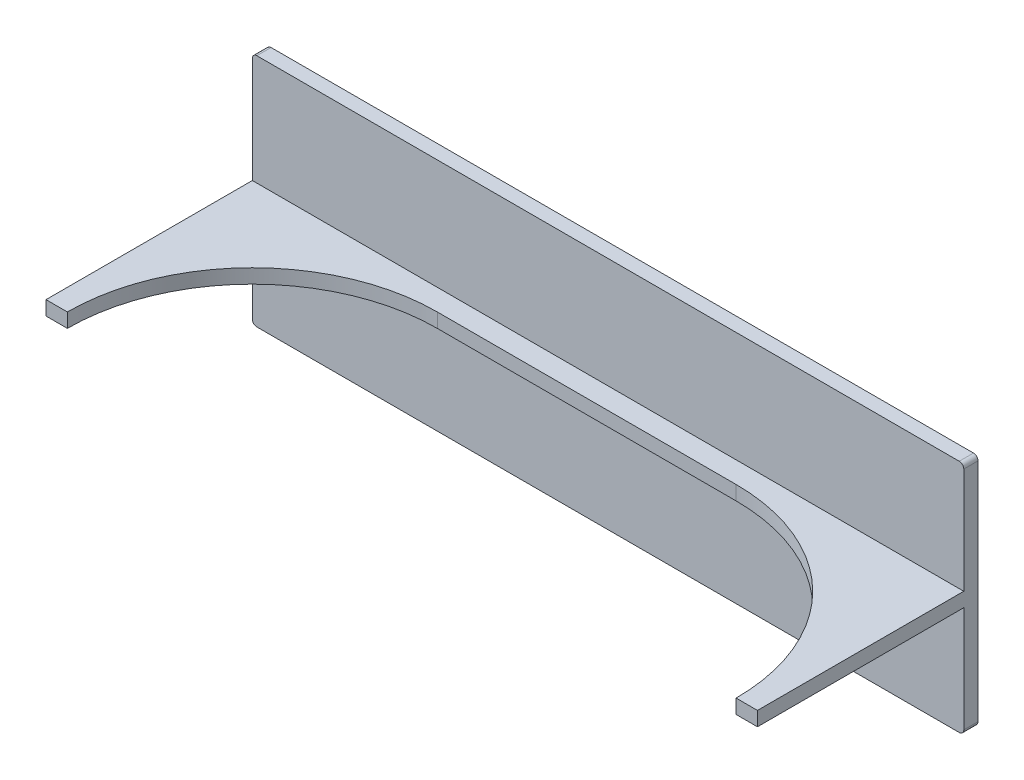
ISO-10303-21;
HEADER;
FILE_DESCRIPTION(('STEP AP214'),'2;1');
FILE_NAME('part.step','',(''),(''),'','','');
FILE_SCHEMA(('AUTOMOTIVE_DESIGN { 1 0 10303 214 1 1 1 1 }'));
ENDSEC;
DATA;
#1=APPLICATION_CONTEXT('core data for automotive mechanical design processes');
#2=APPLICATION_PROTOCOL_DEFINITION('international standard','automotive_design',2000,#1);
#3=PRODUCT_CONTEXT('',#1,'mechanical');
#4=PRODUCT('Part','Part','',(#3));
#5=PRODUCT_RELATED_PRODUCT_CATEGORY('part','',(#4));
#6=PRODUCT_DEFINITION_FORMATION('','',#4);
#7=PRODUCT_DEFINITION_CONTEXT('part definition',#1,'design');
#8=PRODUCT_DEFINITION('design','',#6,#7);
#9=PRODUCT_DEFINITION_SHAPE('','',#8);
#10=(LENGTH_UNIT() NAMED_UNIT(*) SI_UNIT(.MILLI.,.METRE.));
#11=(NAMED_UNIT(*) PLANE_ANGLE_UNIT() SI_UNIT($,.RADIAN.));
#12=(NAMED_UNIT(*) SI_UNIT($,.STERADIAN.) SOLID_ANGLE_UNIT());
#13=UNCERTAINTY_MEASURE_WITH_UNIT(LENGTH_MEASURE(1.E-05),#10,'distance_accuracy_value','');
#14=(GEOMETRIC_REPRESENTATION_CONTEXT(3) GLOBAL_UNCERTAINTY_ASSIGNED_CONTEXT((#13)) GLOBAL_UNIT_ASSIGNED_CONTEXT((#10,
#11,#12)) REPRESENTATION_CONTEXT('',''));
#15=CARTESIAN_POINT('',(0.,0.,0.));
#16=DIRECTION('',(0.,0.,1.));
#17=DIRECTION('',(1.,0.,0.));
#18=AXIS2_PLACEMENT_3D('',#15,#16,#17);
#19=CARTESIAN_POINT('',(0.,0.,10.));
#20=DIRECTION('',(0.,0.,-1.));
#21=DIRECTION('',(-1.,0.,0.));
#22=AXIS2_PLACEMENT_3D('',#19,#20,#21);
#23=PLANE('',#22);
#24=DIRECTION('',(0.,1.,0.));
#25=VECTOR('',#24,1.);
#26=CARTESIAN_POINT('',(250.,-82.55,10.));
#27=LINE('',#26,#25);
#28=CARTESIAN_POINT('',(250.,-79.37,10.));
#29=VERTEX_POINT('',#28);
#30=CARTESIAN_POINT('',(250.,-5.,10.));
#31=VERTEX_POINT('',#30);
#32=EDGE_CURVE('E229',#29,#31,#27,.T.);
#33=ORIENTED_EDGE('',*,*,#32,.T.);
#34=DIRECTION('',(-1.,0.,0.));
#35=VECTOR('',#34,1.);
#36=CARTESIAN_POINT('',(0.,-5.,10.));
#37=LINE('',#36,#35);
#38=CARTESIAN_POINT('',(-250.,-5.,10.));
#39=VERTEX_POINT('',#38);
#40=EDGE_CURVE('E68',#31,#39,#37,.T.);
#41=ORIENTED_EDGE('',*,*,#40,.T.);
#42=DIRECTION('',(0.,-1.,0.));
#43=VECTOR('',#42,1.);
#44=CARTESIAN_POINT('',(-250.,-82.55,10.));
#45=LINE('',#44,#43);
#46=CARTESIAN_POINT('',(-250.,-79.37,10.));
#47=VERTEX_POINT('',#46);
#48=EDGE_CURVE('E234',#39,#47,#45,.T.);
#49=ORIENTED_EDGE('',*,*,#48,.T.);
#50=CARTESIAN_POINT('',(-246.82,-79.37,10.));
#51=DIRECTION('',(0.,0.,-1.));
#52=DIRECTION('',(-1.,0.,0.));
#53=AXIS2_PLACEMENT_3D('',#50,#51,#52);
#54=CIRCLE('',#53,3.18);
#55=CARTESIAN_POINT('',(-246.82,-82.55,10.));
#56=VERTEX_POINT('',#55);
#57=EDGE_CURVE('E271',#47,#56,#54,.F.);
#58=ORIENTED_EDGE('',*,*,#57,.T.);
#59=DIRECTION('',(1.,0.,0.));
#60=VECTOR('',#59,1.);
#61=CARTESIAN_POINT('',(-250.,-82.55,10.));
#62=LINE('',#61,#60);
#63=CARTESIAN_POINT('',(246.82,-82.55,10.));
#64=VERTEX_POINT('',#63);
#65=EDGE_CURVE('E238',#56,#64,#62,.T.);
#66=ORIENTED_EDGE('',*,*,#65,.T.);
#67=CARTESIAN_POINT('',(246.82,-79.37,10.));
#68=DIRECTION('',(0.,0.,-1.));
#69=DIRECTION('',(-1.,0.,0.));
#70=AXIS2_PLACEMENT_3D('',#67,#68,#69);
#71=CIRCLE('',#70,3.18);
#72=EDGE_CURVE('E277',#64,#29,#71,.F.);
#73=ORIENTED_EDGE('',*,*,#72,.T.);
#74=EDGE_LOOP('',(#33,#41,#49,#58,#66,#73));
#75=FACE_BOUND('',#74,.T.);
#76=ADVANCED_FACE('F45',(#75),#23,.F.);
#77=CARTESIAN_POINT('',(250.,-82.55,10.));
#78=DIRECTION('',(-1.,0.,0.));
#79=DIRECTION('',(0.,-1.,0.));
#80=AXIS2_PLACEMENT_3D('',#77,#78,#79);
#81=PLANE('',#80);
#82=ORIENTED_EDGE('',*,*,#32,.F.);
#83=DIRECTION('',(0.,0.,-1.));
#84=VECTOR('',#83,1.);
#85=CARTESIAN_POINT('',(250.,-79.37,10.));
#86=LINE('',#85,#84);
#87=CARTESIAN_POINT('',(250.,-79.37,0.));
#88=VERTEX_POINT('',#87);
#89=EDGE_CURVE('E255',#29,#88,#86,.T.);
#90=ORIENTED_EDGE('',*,*,#89,.T.);
#91=DIRECTION('',(0.,1.,0.));
#92=VECTOR('',#91,1.);
#93=CARTESIAN_POINT('',(250.,-82.55,0.));
#94=LINE('',#93,#92);
#95=CARTESIAN_POINT('',(250.,79.37,0.));
#96=VERTEX_POINT('',#95);
#97=EDGE_CURVE('E228',#88,#96,#94,.T.);
#98=ORIENTED_EDGE('',*,*,#97,.T.);
#99=DIRECTION('',(0.,0.,-1.));
#100=VECTOR('',#99,1.);
#101=CARTESIAN_POINT('',(250.,79.37,10.));
#102=LINE('',#101,#100);
#103=CARTESIAN_POINT('',(250.,79.37,10.));
#104=VERTEX_POINT('',#103);
#105=EDGE_CURVE('E241',#96,#104,#102,.F.);
#106=ORIENTED_EDGE('',*,*,#105,.T.);
#107=CARTESIAN_POINT('',(250.,5.,10.));
#108=VERTEX_POINT('',#107);
#109=EDGE_CURVE('E185',#108,#104,#27,.T.);
#110=ORIENTED_EDGE('',*,*,#109,.F.);
#111=DIRECTION('',(0.,0.,1.));
#112=VECTOR('',#111,1.);
#113=CARTESIAN_POINT('',(250.,5.,0.));
#114=LINE('',#113,#112);
#115=CARTESIAN_POINT('',(250.,5.,155.));
#116=VERTEX_POINT('',#115);
#117=EDGE_CURVE('E177',#108,#116,#114,.T.);
#118=ORIENTED_EDGE('',*,*,#117,.T.);
#119=DIRECTION('',(0.,-1.,0.));
#120=VECTOR('',#119,1.);
#121=CARTESIAN_POINT('',(250.,5.,155.));
#122=LINE('',#121,#120);
#123=CARTESIAN_POINT('',(250.,-5.,155.));
#124=VERTEX_POINT('',#123);
#125=EDGE_CURVE('E160',#116,#124,#122,.T.);
#126=ORIENTED_EDGE('',*,*,#125,.T.);
#127=DIRECTION('',(0.,0.,1.));
#128=VECTOR('',#127,1.);
#129=CARTESIAN_POINT('',(250.,-5.,0.));
#130=LINE('',#129,#128);
#131=EDGE_CURVE('E191',#31,#124,#130,.T.);
#132=ORIENTED_EDGE('',*,*,#131,.F.);
#133=EDGE_LOOP('',(#82,#90,#98,#106,#110,#118,#126,#132));
#134=FACE_BOUND('',#133,.T.);
#135=ADVANCED_FACE('F183',(#134),#81,.F.);
#136=CARTESIAN_POINT('',(-250.,82.55,10.));
#137=DIRECTION('',(0.,-1.,0.));
#138=DIRECTION('',(1.,0.,0.));
#139=AXIS2_PLACEMENT_3D('',#136,#137,#138);
#140=PLANE('',#139);
#141=DIRECTION('',(-1.,0.,0.));
#142=VECTOR('',#141,1.);
#143=CARTESIAN_POINT('',(-250.,82.55,10.));
#144=LINE('',#143,#142);
#145=CARTESIAN_POINT('',(246.82,82.55,10.));
#146=VERTEX_POINT('',#145);
#147=CARTESIAN_POINT('',(-246.82,82.55,10.));
#148=VERTEX_POINT('',#147);
#149=EDGE_CURVE('E231',#146,#148,#144,.T.);
#150=ORIENTED_EDGE('',*,*,#149,.F.);
#151=DIRECTION('',(0.,0.,-1.));
#152=VECTOR('',#151,1.);
#153=CARTESIAN_POINT('',(246.82,82.55,10.));
#154=LINE('',#153,#152);
#155=CARTESIAN_POINT('',(246.82,82.55,0.));
#156=VERTEX_POINT('',#155);
#157=EDGE_CURVE('E281',#146,#156,#154,.T.);
#158=ORIENTED_EDGE('',*,*,#157,.T.);
#159=DIRECTION('',(-1.,0.,0.));
#160=VECTOR('',#159,1.);
#161=CARTESIAN_POINT('',(-250.,82.55,0.));
#162=LINE('',#161,#160);
#163=CARTESIAN_POINT('',(-246.82,82.55,0.));
#164=VERTEX_POINT('',#163);
#165=EDGE_CURVE('E244',#156,#164,#162,.T.);
#166=ORIENTED_EDGE('',*,*,#165,.T.);
#167=DIRECTION('',(0.,0.,-1.));
#168=VECTOR('',#167,1.);
#169=CARTESIAN_POINT('',(-246.82,82.55,10.));
#170=LINE('',#169,#168);
#171=EDGE_CURVE('E279',#164,#148,#170,.F.);
#172=ORIENTED_EDGE('',*,*,#171,.T.);
#173=EDGE_LOOP('',(#150,#158,#166,#172));
#174=FACE_BOUND('',#173,.T.);
#175=ADVANCED_FACE('F339',(#174),#140,.F.);
#176=CARTESIAN_POINT('',(-250.,-82.55,10.));
#177=DIRECTION('',(1.,0.,0.));
#178=DIRECTION('',(0.,0.,-1.));
#179=AXIS2_PLACEMENT_3D('',#176,#177,#178);
#180=PLANE('',#179);
#181=CARTESIAN_POINT('',(-250.,79.37,10.));
#182=VERTEX_POINT('',#181);
#183=CARTESIAN_POINT('',(-250.,5.,10.));
#184=VERTEX_POINT('',#183);
#185=EDGE_CURVE('E235',#182,#184,#45,.T.);
#186=ORIENTED_EDGE('',*,*,#185,.F.);
#187=DIRECTION('',(0.,0.,-1.));
#188=VECTOR('',#187,1.);
#189=CARTESIAN_POINT('',(-250.,79.37,10.));
#190=LINE('',#189,#188);
#191=CARTESIAN_POINT('',(-250.,79.37,0.));
#192=VERTEX_POINT('',#191);
#193=EDGE_CURVE('E11',#182,#192,#190,.T.);
#194=ORIENTED_EDGE('',*,*,#193,.T.);
#195=DIRECTION('',(0.,-1.,0.));
#196=VECTOR('',#195,1.);
#197=CARTESIAN_POINT('',(-250.,-82.55,0.));
#198=LINE('',#197,#196);
#199=CARTESIAN_POINT('',(-250.,-79.37,0.));
#200=VERTEX_POINT('',#199);
#201=EDGE_CURVE('E247',#192,#200,#198,.T.);
#202=ORIENTED_EDGE('',*,*,#201,.T.);
#203=DIRECTION('',(0.,0.,-1.));
#204=VECTOR('',#203,1.);
#205=CARTESIAN_POINT('',(-250.,-79.37,10.));
#206=LINE('',#205,#204);
#207=EDGE_CURVE('E53',#200,#47,#206,.F.);
#208=ORIENTED_EDGE('',*,*,#207,.T.);
#209=ORIENTED_EDGE('',*,*,#48,.F.);
#210=DIRECTION('',(0.,0.,1.));
#211=VECTOR('',#210,1.);
#212=CARTESIAN_POINT('',(-250.,-5.,0.));
#213=LINE('',#212,#211);
#214=CARTESIAN_POINT('',(-250.,-5.,155.));
#215=VERTEX_POINT('',#214);
#216=EDGE_CURVE('E201',#39,#215,#213,.T.);
#217=ORIENTED_EDGE('',*,*,#216,.T.);
#218=DIRECTION('',(0.,-1.,0.));
#219=VECTOR('',#218,1.);
#220=CARTESIAN_POINT('',(-250.,5.,155.));
#221=LINE('',#220,#219);
#222=CARTESIAN_POINT('',(-250.,5.,155.));
#223=VERTEX_POINT('',#222);
#224=EDGE_CURVE('E210',#223,#215,#221,.T.);
#225=ORIENTED_EDGE('',*,*,#224,.F.);
#226=DIRECTION('',(0.,0.,1.));
#227=VECTOR('',#226,1.);
#228=CARTESIAN_POINT('',(-250.,5.,0.));
#229=LINE('',#228,#227);
#230=EDGE_CURVE('E207',#184,#223,#229,.T.);
#231=ORIENTED_EDGE('',*,*,#230,.F.);
#232=EDGE_LOOP('',(#186,#194,#202,#208,#209,#217,#225,#231));
#233=FACE_BOUND('',#232,.T.);
#234=ADVANCED_FACE('F289',(#233),#180,.F.);
#235=CARTESIAN_POINT('',(-250.,-82.55,10.));
#236=DIRECTION('',(0.,1.,0.));
#237=DIRECTION('',(-1.,0.,0.));
#238=AXIS2_PLACEMENT_3D('',#235,#236,#237);
#239=PLANE('',#238);
#240=DIRECTION('',(1.,0.,0.));
#241=VECTOR('',#240,1.);
#242=CARTESIAN_POINT('',(-250.,-82.55,0.));
#243=LINE('',#242,#241);
#244=CARTESIAN_POINT('',(-246.82,-82.55,0.));
#245=VERTEX_POINT('',#244);
#246=CARTESIAN_POINT('',(246.82,-82.55,0.));
#247=VERTEX_POINT('',#246);
#248=EDGE_CURVE('E251',#245,#247,#243,.T.);
#249=ORIENTED_EDGE('',*,*,#248,.T.);
#250=DIRECTION('',(0.,0.,-1.));
#251=VECTOR('',#250,1.);
#252=CARTESIAN_POINT('',(246.82,-82.55,10.));
#253=LINE('',#252,#251);
#254=EDGE_CURVE('E269',#247,#64,#253,.F.);
#255=ORIENTED_EDGE('',*,*,#254,.T.);
#256=ORIENTED_EDGE('',*,*,#65,.F.);
#257=DIRECTION('',(0.,0.,-1.));
#258=VECTOR('',#257,1.);
#259=CARTESIAN_POINT('',(-246.82,-82.55,10.));
#260=LINE('',#259,#258);
#261=EDGE_CURVE('E266',#56,#245,#260,.T.);
#262=ORIENTED_EDGE('',*,*,#261,.T.);
#263=EDGE_LOOP('',(#249,#255,#256,#262));
#264=FACE_BOUND('',#263,.T.);
#265=ADVANCED_FACE('F297',(#264),#239,.F.);
#266=DIRECTION('',(-1.,0.,0.));
#267=VECTOR('',#266,1.);
#268=CARTESIAN_POINT('',(0.,5.,10.));
#269=LINE('',#268,#267);
#270=EDGE_CURVE('E60',#108,#184,#269,.T.);
#271=ORIENTED_EDGE('',*,*,#270,.F.);
#272=ORIENTED_EDGE('',*,*,#109,.T.);
#273=CARTESIAN_POINT('',(246.82,79.37,10.));
#274=DIRECTION('',(0.,0.,-1.));
#275=DIRECTION('',(-1.,0.,0.));
#276=AXIS2_PLACEMENT_3D('',#273,#274,#275);
#277=CIRCLE('',#276,3.18);
#278=EDGE_CURVE('E275',#104,#146,#277,.F.);
#279=ORIENTED_EDGE('',*,*,#278,.T.);
#280=ORIENTED_EDGE('',*,*,#149,.T.);
#281=CARTESIAN_POINT('',(-246.82,79.37,10.));
#282=DIRECTION('',(0.,0.,-1.));
#283=DIRECTION('',(-1.,0.,0.));
#284=AXIS2_PLACEMENT_3D('',#281,#282,#283);
#285=CIRCLE('',#284,3.18);
#286=EDGE_CURVE('E273',#148,#182,#285,.F.);
#287=ORIENTED_EDGE('',*,*,#286,.T.);
#288=ORIENTED_EDGE('',*,*,#185,.T.);
#289=EDGE_LOOP('',(#271,#272,#279,#280,#287,#288));
#290=FACE_BOUND('',#289,.T.);
#291=ADVANCED_FACE('F324',(#290),#23,.F.);
#292=CARTESIAN_POINT('',(0.,0.,0.));
#293=DIRECTION('',(0.,0.,-1.));
#294=DIRECTION('',(-1.,0.,0.));
#295=AXIS2_PLACEMENT_3D('',#292,#293,#294);
#296=PLANE('',#295);
#297=ORIENTED_EDGE('',*,*,#97,.F.);
#298=CARTESIAN_POINT('',(246.82,-79.37,0.));
#299=DIRECTION('',(0.,0.,-1.));
#300=DIRECTION('',(-1.,0.,0.));
#301=AXIS2_PLACEMENT_3D('',#298,#299,#300);
#302=CIRCLE('',#301,3.18);
#303=EDGE_CURVE('E264',#88,#247,#302,.T.);
#304=ORIENTED_EDGE('',*,*,#303,.T.);
#305=ORIENTED_EDGE('',*,*,#248,.F.);
#306=CARTESIAN_POINT('',(-246.82,-79.37,0.));
#307=DIRECTION('',(0.,0.,-1.));
#308=DIRECTION('',(-1.,0.,0.));
#309=AXIS2_PLACEMENT_3D('',#306,#307,#308);
#310=CIRCLE('',#309,3.18);
#311=EDGE_CURVE('E258',#245,#200,#310,.T.);
#312=ORIENTED_EDGE('',*,*,#311,.T.);
#313=ORIENTED_EDGE('',*,*,#201,.F.);
#314=CARTESIAN_POINT('',(-246.82,79.37,0.));
#315=DIRECTION('',(0.,0.,-1.));
#316=DIRECTION('',(-1.,0.,0.));
#317=AXIS2_PLACEMENT_3D('',#314,#315,#316);
#318=CIRCLE('',#317,3.18);
#319=EDGE_CURVE('E260',#192,#164,#318,.T.);
#320=ORIENTED_EDGE('',*,*,#319,.T.);
#321=ORIENTED_EDGE('',*,*,#165,.F.);
#322=CARTESIAN_POINT('',(246.82,79.37,0.));
#323=DIRECTION('',(0.,0.,-1.));
#324=DIRECTION('',(-1.,0.,0.));
#325=AXIS2_PLACEMENT_3D('',#322,#323,#324);
#326=CIRCLE('',#325,3.18);
#327=EDGE_CURVE('E262',#156,#96,#326,.T.);
#328=ORIENTED_EDGE('',*,*,#327,.T.);
#329=EDGE_LOOP('',(#297,#304,#305,#312,#313,#320,#321,#328));
#330=FACE_BOUND('',#329,.T.);
#331=ADVANCED_FACE('F331',(#330),#296,.T.);
#332=CARTESIAN_POINT('',(246.82,-79.37,10.));
#333=DIRECTION('',(0.,0.,-1.));
#334=DIRECTION('',(-1.,0.,0.));
#335=AXIS2_PLACEMENT_3D('',#332,#333,#334);
#336=CYLINDRICAL_SURFACE('',#335,3.18);
#337=ORIENTED_EDGE('',*,*,#72,.F.);
#338=ORIENTED_EDGE('',*,*,#254,.F.);
#339=ORIENTED_EDGE('',*,*,#303,.F.);
#340=ORIENTED_EDGE('',*,*,#89,.F.);
#341=EDGE_LOOP('',(#337,#338,#339,#340));
#342=FACE_BOUND('',#341,.T.);
#343=ADVANCED_FACE('F301',(#342),#336,.T.);
#344=CARTESIAN_POINT('',(246.82,79.37,10.));
#345=DIRECTION('',(0.,0.,-1.));
#346=DIRECTION('',(-1.,0.,0.));
#347=AXIS2_PLACEMENT_3D('',#344,#345,#346);
#348=CYLINDRICAL_SURFACE('',#347,3.18);
#349=ORIENTED_EDGE('',*,*,#278,.F.);
#350=ORIENTED_EDGE('',*,*,#105,.F.);
#351=ORIENTED_EDGE('',*,*,#327,.F.);
#352=ORIENTED_EDGE('',*,*,#157,.F.);
#353=EDGE_LOOP('',(#349,#350,#351,#352));
#354=FACE_BOUND('',#353,.T.);
#355=ADVANCED_FACE('F336',(#354),#348,.T.);
#356=CARTESIAN_POINT('',(-246.82,79.37,10.));
#357=DIRECTION('',(0.,0.,-1.));
#358=DIRECTION('',(-1.,0.,0.));
#359=AXIS2_PLACEMENT_3D('',#356,#357,#358);
#360=CYLINDRICAL_SURFACE('',#359,3.18);
#361=ORIENTED_EDGE('',*,*,#286,.F.);
#362=ORIENTED_EDGE('',*,*,#171,.F.);
#363=ORIENTED_EDGE('',*,*,#319,.F.);
#364=ORIENTED_EDGE('',*,*,#193,.F.);
#365=EDGE_LOOP('',(#361,#362,#363,#364));
#366=FACE_BOUND('',#365,.T.);
#367=ADVANCED_FACE('F329',(#366),#360,.T.);
#368=CARTESIAN_POINT('',(-246.82,-79.37,10.));
#369=DIRECTION('',(0.,0.,-1.));
#370=DIRECTION('',(-1.,0.,0.));
#371=AXIS2_PLACEMENT_3D('',#368,#369,#370);
#372=CYLINDRICAL_SURFACE('',#371,3.18);
#373=ORIENTED_EDGE('',*,*,#57,.F.);
#374=ORIENTED_EDGE('',*,*,#207,.F.);
#375=ORIENTED_EDGE('',*,*,#311,.F.);
#376=ORIENTED_EDGE('',*,*,#261,.F.);
#377=EDGE_LOOP('',(#373,#374,#375,#376));
#378=FACE_BOUND('',#377,.T.);
#379=ADVANCED_FACE('F47',(#378),#372,.T.);
#380=CARTESIAN_POINT('',(0.,5.,155.));
#381=DIRECTION('',(0.,0.,-1.));
#382=DIRECTION('',(-1.,0.,0.));
#383=AXIS2_PLACEMENT_3D('',#380,#381,#382);
#384=PLANE('',#383);
#385=DIRECTION('',(1.,0.,0.));
#386=VECTOR('',#385,1.);
#387=CARTESIAN_POINT('',(0.,-5.,155.));
#388=LINE('',#387,#386);
#389=CARTESIAN_POINT('',(-235.,-5.,155.));
#390=VERTEX_POINT('',#389);
#391=EDGE_CURVE('E170',#215,#390,#388,.T.);
#392=ORIENTED_EDGE('',*,*,#391,.T.);
#393=DIRECTION('',(0.,-1.,0.));
#394=VECTOR('',#393,1.);
#395=CARTESIAN_POINT('',(-235.,5.,155.));
#396=LINE('',#395,#394);
#397=CARTESIAN_POINT('',(-235.,5.,155.));
#398=VERTEX_POINT('',#397);
#399=EDGE_CURVE('E225',#398,#390,#396,.T.);
#400=ORIENTED_EDGE('',*,*,#399,.F.);
#401=DIRECTION('',(1.,0.,0.));
#402=VECTOR('',#401,1.);
#403=CARTESIAN_POINT('',(0.,5.,155.));
#404=LINE('',#403,#402);
#405=EDGE_CURVE('E198',#223,#398,#404,.T.);
#406=ORIENTED_EDGE('',*,*,#405,.F.);
#407=ORIENTED_EDGE('',*,*,#224,.T.);
#408=EDGE_LOOP('',(#392,#400,#406,#407));
#409=FACE_BOUND('',#408,.T.);
#410=ADVANCED_FACE('F320',(#409),#384,.F.);
#411=CARTESIAN_POINT('',(-105.,5.,155.));
#412=DIRECTION('',(0.,-1.,0.));
#413=DIRECTION('',(0.,0.,-1.));
#414=AXIS2_PLACEMENT_3D('',#411,#412,#413);
#415=CYLINDRICAL_SURFACE('',#414,130.);
#416=CARTESIAN_POINT('',(-105.,-5.,155.));
#417=DIRECTION('',(0.,1.,0.));
#418=DIRECTION('',(0.,0.,1.));
#419=AXIS2_PLACEMENT_3D('',#416,#417,#418);
#420=CIRCLE('',#419,130.);
#421=CARTESIAN_POINT('',(-105.,-5.,25.));
#422=VERTEX_POINT('',#421);
#423=EDGE_CURVE('E213',#390,#422,#420,.F.);
#424=ORIENTED_EDGE('',*,*,#423,.T.);
#425=DIRECTION('',(0.,-1.,0.));
#426=VECTOR('',#425,1.);
#427=CARTESIAN_POINT('',(-105.,5.,25.));
#428=LINE('',#427,#426);
#429=CARTESIAN_POINT('',(-105.,5.,25.));
#430=VERTEX_POINT('',#429);
#431=EDGE_CURVE('E222',#430,#422,#428,.T.);
#432=ORIENTED_EDGE('',*,*,#431,.F.);
#433=CARTESIAN_POINT('',(-105.,5.,155.));
#434=DIRECTION('',(0.,1.,0.));
#435=DIRECTION('',(0.,0.,1.));
#436=AXIS2_PLACEMENT_3D('',#433,#434,#435);
#437=CIRCLE('',#436,130.);
#438=EDGE_CURVE('E200',#398,#430,#437,.F.);
#439=ORIENTED_EDGE('',*,*,#438,.F.);
#440=ORIENTED_EDGE('',*,*,#399,.T.);
#441=EDGE_LOOP('',(#424,#432,#439,#440));
#442=FACE_BOUND('',#441,.T.);
#443=ADVANCED_FACE('F317',(#442),#415,.F.);
#444=CARTESIAN_POINT('',(0.,5.,25.));
#445=DIRECTION('',(0.,0.,-1.));
#446=DIRECTION('',(-1.,0.,0.));
#447=AXIS2_PLACEMENT_3D('',#444,#445,#446);
#448=PLANE('',#447);
#449=DIRECTION('',(1.,0.,0.));
#450=VECTOR('',#449,1.);
#451=CARTESIAN_POINT('',(0.,-5.,25.));
#452=LINE('',#451,#450);
#453=CARTESIAN_POINT('',(105.,-5.,25.));
#454=VERTEX_POINT('',#453);
#455=EDGE_CURVE('E215',#422,#454,#452,.T.);
#456=ORIENTED_EDGE('',*,*,#455,.T.);
#457=DIRECTION('',(0.,-1.,0.));
#458=VECTOR('',#457,1.);
#459=CARTESIAN_POINT('',(105.,5.,25.));
#460=LINE('',#459,#458);
#461=CARTESIAN_POINT('',(105.,5.,25.));
#462=VERTEX_POINT('',#461);
#463=EDGE_CURVE('E171',#462,#454,#460,.T.);
#464=ORIENTED_EDGE('',*,*,#463,.F.);
#465=DIRECTION('',(1.,0.,0.));
#466=VECTOR('',#465,1.);
#467=CARTESIAN_POINT('',(0.,5.,25.));
#468=LINE('',#467,#466);
#469=EDGE_CURVE('E203',#430,#462,#468,.T.);
#470=ORIENTED_EDGE('',*,*,#469,.F.);
#471=ORIENTED_EDGE('',*,*,#431,.T.);
#472=EDGE_LOOP('',(#456,#464,#470,#471));
#473=FACE_BOUND('',#472,.T.);
#474=ADVANCED_FACE('F313',(#473),#448,.F.);
#475=CARTESIAN_POINT('',(0.,5.,0.));
#476=DIRECTION('',(0.,1.,0.));
#477=DIRECTION('',(0.,0.,1.));
#478=AXIS2_PLACEMENT_3D('',#475,#476,#477);
#479=PLANE('',#478);
#480=ORIENTED_EDGE('',*,*,#405,.T.);
#481=ORIENTED_EDGE('',*,*,#438,.T.);
#482=ORIENTED_EDGE('',*,*,#469,.T.);
#483=CARTESIAN_POINT('',(105.,5.,155.));
#484=DIRECTION('',(0.,-1.,0.));
#485=DIRECTION('',(0.,0.,1.));
#486=AXIS2_PLACEMENT_3D('',#483,#484,#485);
#487=CIRCLE('',#486,130.);
#488=CARTESIAN_POINT('',(235.,5.,155.));
#489=VERTEX_POINT('',#488);
#490=EDGE_CURVE('E179',#489,#462,#487,.F.);
#491=ORIENTED_EDGE('',*,*,#490,.F.);
#492=DIRECTION('',(-1.,0.,0.));
#493=VECTOR('',#492,1.);
#494=CARTESIAN_POINT('',(0.,5.,155.));
#495=LINE('',#494,#493);
#496=EDGE_CURVE('E163',#116,#489,#495,.T.);
#497=ORIENTED_EDGE('',*,*,#496,.F.);
#498=ORIENTED_EDGE('',*,*,#117,.F.);
#499=ORIENTED_EDGE('',*,*,#270,.T.);
#500=ORIENTED_EDGE('',*,*,#230,.T.);
#501=EDGE_LOOP('',(#480,#481,#482,#491,#497,#498,#499,#500));
#502=FACE_BOUND('',#501,.T.);
#503=ADVANCED_FACE('F176',(#502),#479,.T.);
#504=CARTESIAN_POINT('',(0.,-5.,0.));
#505=DIRECTION('',(0.,1.,0.));
#506=DIRECTION('',(0.,0.,1.));
#507=AXIS2_PLACEMENT_3D('',#504,#505,#506);
#508=PLANE('',#507);
#509=ORIENTED_EDGE('',*,*,#391,.F.);
#510=ORIENTED_EDGE('',*,*,#216,.F.);
#511=ORIENTED_EDGE('',*,*,#40,.F.);
#512=ORIENTED_EDGE('',*,*,#131,.T.);
#513=DIRECTION('',(-1.,0.,0.));
#514=VECTOR('',#513,1.);
#515=CARTESIAN_POINT('',(0.,-5.,155.));
#516=LINE('',#515,#514);
#517=CARTESIAN_POINT('',(235.,-5.,155.));
#518=VERTEX_POINT('',#517);
#519=EDGE_CURVE('E166',#124,#518,#516,.T.);
#520=ORIENTED_EDGE('',*,*,#519,.T.);
#521=CARTESIAN_POINT('',(105.,-5.,155.));
#522=DIRECTION('',(0.,-1.,0.));
#523=DIRECTION('',(0.,0.,1.));
#524=AXIS2_PLACEMENT_3D('',#521,#522,#523);
#525=CIRCLE('',#524,130.);
#526=EDGE_CURVE('E180',#518,#454,#525,.F.);
#527=ORIENTED_EDGE('',*,*,#526,.T.);
#528=ORIENTED_EDGE('',*,*,#455,.F.);
#529=ORIENTED_EDGE('',*,*,#423,.F.);
#530=EDGE_LOOP('',(#509,#510,#511,#512,#520,#527,#528,#529));
#531=FACE_BOUND('',#530,.T.);
#532=ADVANCED_FACE('F305',(#531),#508,.F.);
#533=CARTESIAN_POINT('',(0.,5.,155.));
#534=DIRECTION('',(0.,0.,1.));
#535=DIRECTION('',(1.,0.,0.));
#536=AXIS2_PLACEMENT_3D('',#533,#534,#535);
#537=PLANE('',#536);
#538=ORIENTED_EDGE('',*,*,#519,.F.);
#539=ORIENTED_EDGE('',*,*,#125,.F.);
#540=ORIENTED_EDGE('',*,*,#496,.T.);
#541=DIRECTION('',(0.,-1.,0.));
#542=VECTOR('',#541,1.);
#543=CARTESIAN_POINT('',(235.,5.,155.));
#544=LINE('',#543,#542);
#545=EDGE_CURVE('E187',#489,#518,#544,.T.);
#546=ORIENTED_EDGE('',*,*,#545,.T.);
#547=EDGE_LOOP('',(#538,#539,#540,#546));
#548=FACE_BOUND('',#547,.T.);
#549=ADVANCED_FACE('F162',(#548),#537,.T.);
#550=CARTESIAN_POINT('',(105.,5.,155.));
#551=DIRECTION('',(0.,-1.,0.));
#552=DIRECTION('',(0.,0.,-1.));
#553=AXIS2_PLACEMENT_3D('',#550,#551,#552);
#554=CYLINDRICAL_SURFACE('',#553,130.);
#555=ORIENTED_EDGE('',*,*,#526,.F.);
#556=ORIENTED_EDGE('',*,*,#545,.F.);
#557=ORIENTED_EDGE('',*,*,#490,.T.);
#558=ORIENTED_EDGE('',*,*,#463,.T.);
#559=EDGE_LOOP('',(#555,#556,#557,#558));
#560=FACE_BOUND('',#559,.T.);
#561=ADVANCED_FACE('F309',(#560),#554,.F.);
#562=CLOSED_SHELL('',(#76,#135,#175,#234,#265,#291,#331,#343,#355,#367,#379,#410,#443,#474,#503,
#532,#549,#561));
#563=MANIFOLD_SOLID_BREP('B2',#562);
#564=ADVANCED_BREP_SHAPE_REPRESENTATION('',(#18,#563),#14);
#565=SHAPE_DEFINITION_REPRESENTATION(#9,#564);
ENDSEC;
END-ISO-10303-21;
